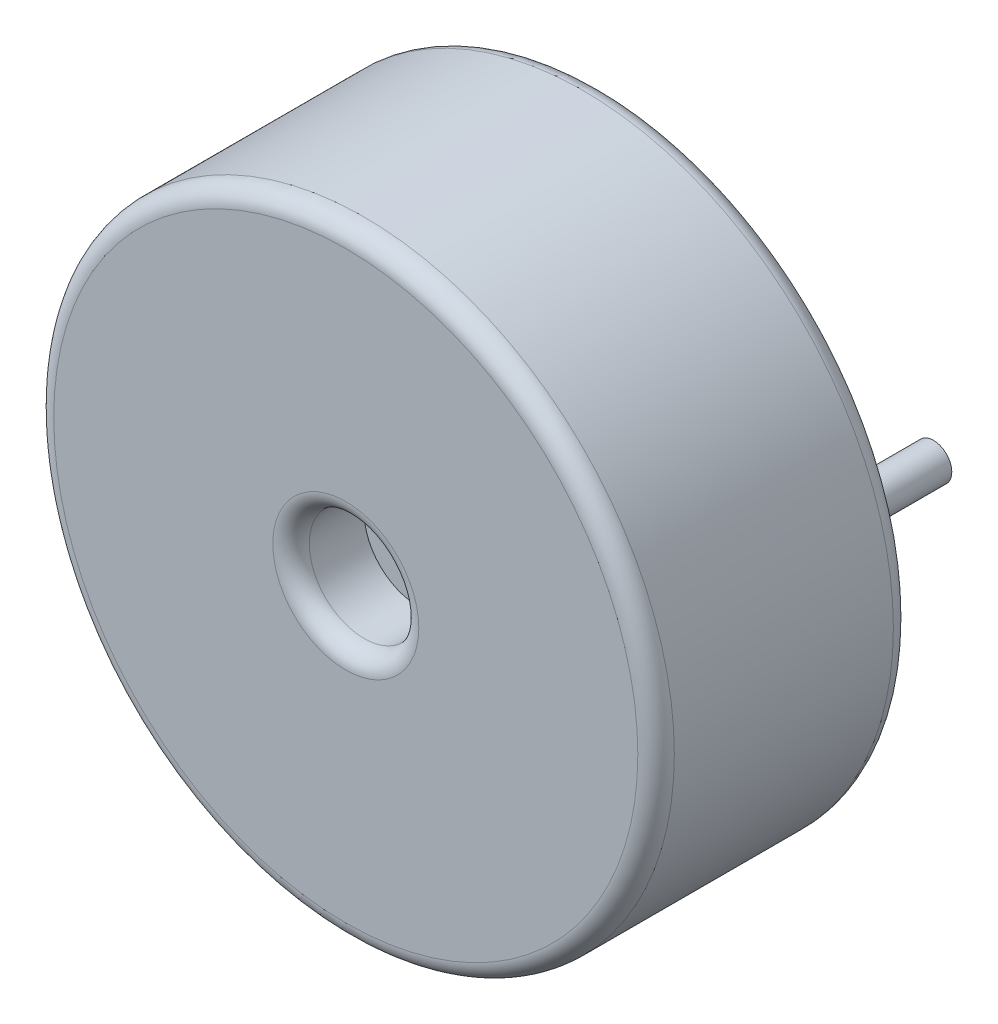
from build123d import *

# Parameters (mm, degrees)
ESQUISSE1_R             = 8.5
EXTRUSION1_DEPTH        = 7
ESQUISSE2_R             = 1.5
ENL_V_MAT_EXTRU_1_DEPTH = 2
ESQUISSE3_R             = 0.5
EXTRUSION2_DEPTH        = 4
CONG_1_R                = 0.5


with BuildPart() as part:
    # Esquisse1 → Extrusion1 (new body)
    with BuildSketch(Plane.XY):
        Circle(ESQUISSE1_R)
    extrude(amount=EXTRUSION1_DEPTH)

    # Esquisse2 → Enl_v. mat.-Extru.1 (cut)
    with BuildSketch(Plane.XY.offset(7)):
        Circle(ESQUISSE2_R)
    extrude(amount=-ENL_V_MAT_EXTRU_1_DEPTH, mode=Mode.SUBTRACT)

    # Esquisse3 → Extrusion2 (add)
    with BuildSketch(Plane(origin=(0, 0, 0), x_dir=(-1, 0, 0), z_dir=(0, 0, -1))):
        with Locations(Location((-5.1, 0, 0), (0, 0, 180))):
            Circle(ESQUISSE3_R)
        with Locations(Location((5.1, 0, 0), (0, 0, 180))):
            Circle(ESQUISSE3_R)
    extrude(amount=EXTRUSION2_DEPTH)

    # Cong_1
    cong_1_edges = [part.edges().sort_by_distance(p)[0] for p in [
        (-8.5, 0, 0),
        (-8.5, 0, 7),
        (-1.5, 0, 7),
    ]]
    fillet(cong_1_edges, radius=CONG_1_R)


solid = part.part
